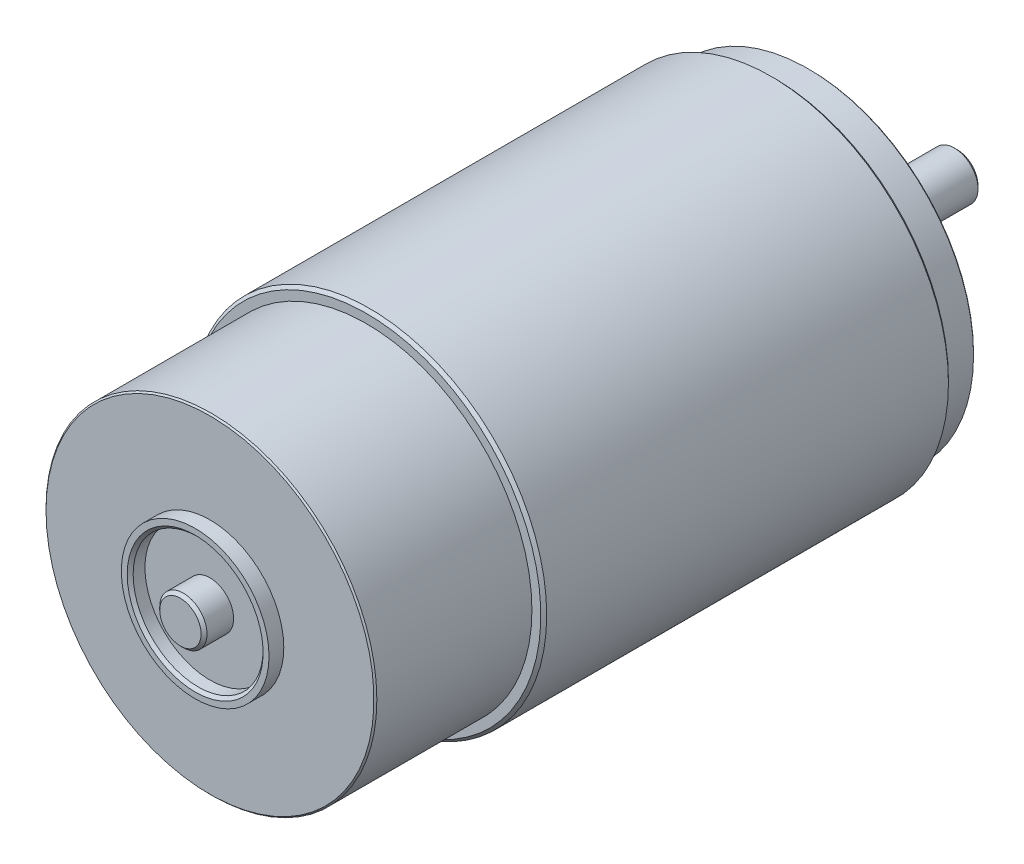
from build123d import *

# Parameters (mm, degrees)
CHAMFER1_SIZE = 0.5
CHAMFER2_SIZE = 0.5
CHAMFER3_SIZE = 0.5
CHAMFER4_SIZE = 0.25


with BuildPart() as part:
    # Sketch1 → Revolve1 (revolve)
    with BuildSketch(Plane(origin=(0, 0, 0), x_dir=(1, 0, 0), z_dir=(0, 1, 0)), mode=Mode.PRIVATE) as revolve1_sk:
        Polygon((-8.537930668, -81.048340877), (-12.537930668, -81.048340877), (-12.537930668, -76.048340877), (-19.537930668, -76.048340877), (-19.537930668, -78.548340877), (-21.037930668, -78.548340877), (-21.037930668, -76.048340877), (-36.537930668, -76.048340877), (-36.537930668, -49.548340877), (-38.537930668, -49.548340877), (-38.537930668, 19.451659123), (-36.537930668, 19.451659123), (-36.537930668, 25.451659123), (-21.037930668, 25.451659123), (-21.037930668, 27.951659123), (-19.537930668, 27.951659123), (-19.537930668, 25.451659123), (-12.537930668, 25.451659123), (-12.537930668, 50.451659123), (-8.537930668, 50.451659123), align=None)
    revolve(revolve1_sk.sketch.rotate(Axis((-8.537930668, 0, 81.048340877), (0, 0, -1)), 180), axis=Axis((-8.537930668, 0, 81.048340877), (0, 0, -1)))

    # Chamfer1
    chamfer1_edges = [part.edges().sort_by_distance(p)[0] for p in [
        (-38.537930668, 0, -19.451659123),
        (-38.537930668, 0, 49.548340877),
    ]]
    chamfer(chamfer1_edges, length=CHAMFER1_SIZE)

    # Chamfer2
    chamfer2_edges = [part.edges().sort_by_distance(p)[0] for p in [
        (-19.537930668, 0, -27.951659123),
        (-19.537930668, 0, 78.548340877),
    ]]
    chamfer(chamfer2_edges, length=CHAMFER2_SIZE)

    # Chamfer3
    chamfer3_edges = [part.edges().sort_by_distance(p)[0] for p in [
        (-12.537930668, 0, -50.451659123),
        (-12.537930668, 0, 81.048340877),
    ]]
    chamfer(chamfer3_edges, length=CHAMFER3_SIZE)

    # Chamfer4
    chamfer4_edges = [part.edges().sort_by_distance(p)[0] for p in [
        (-36.537930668, 0, -25.451659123),
        (-36.537930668, 0, 76.048340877),
    ]]
    chamfer(chamfer4_edges, length=CHAMFER4_SIZE)


solid = part.part
